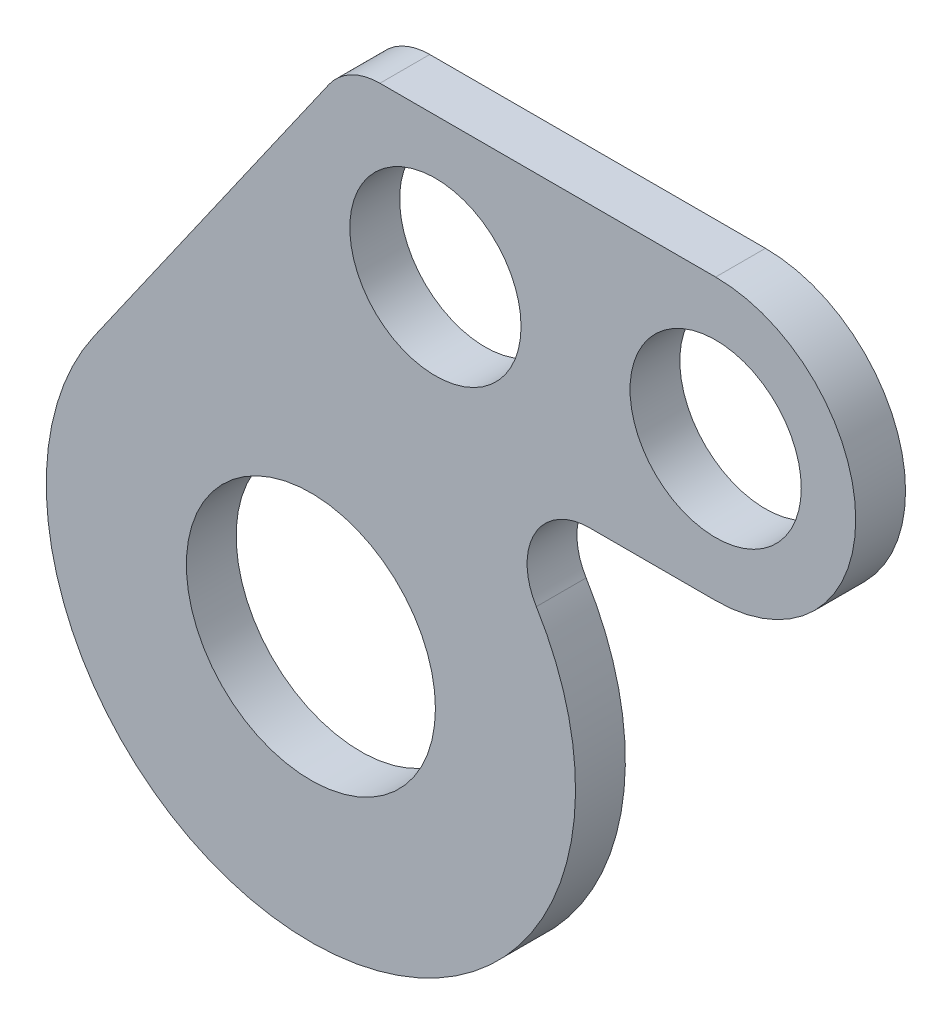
ISO-10303-21;
HEADER;
FILE_DESCRIPTION(('STEP AP214'),'2;1');
FILE_NAME('part.step','',(''),(''),'','','');
FILE_SCHEMA(('AUTOMOTIVE_DESIGN { 1 0 10303 214 1 1 1 1 }'));
ENDSEC;
DATA;
#1=APPLICATION_CONTEXT('core data for automotive mechanical design processes');
#2=APPLICATION_PROTOCOL_DEFINITION('international standard','automotive_design',2000,#1);
#3=PRODUCT_CONTEXT('',#1,'mechanical');
#4=PRODUCT('Part','Part','',(#3));
#5=PRODUCT_RELATED_PRODUCT_CATEGORY('part','',(#4));
#6=PRODUCT_DEFINITION_FORMATION('','',#4);
#7=PRODUCT_DEFINITION_CONTEXT('part definition',#1,'design');
#8=PRODUCT_DEFINITION('design','',#6,#7);
#9=PRODUCT_DEFINITION_SHAPE('','',#8);
#10=(LENGTH_UNIT() NAMED_UNIT(*) SI_UNIT(.MILLI.,.METRE.));
#11=(NAMED_UNIT(*) PLANE_ANGLE_UNIT() SI_UNIT($,.RADIAN.));
#12=(NAMED_UNIT(*) SI_UNIT($,.STERADIAN.) SOLID_ANGLE_UNIT());
#13=UNCERTAINTY_MEASURE_WITH_UNIT(LENGTH_MEASURE(1.E-05),#10,'distance_accuracy_value','');
#14=(GEOMETRIC_REPRESENTATION_CONTEXT(3) GLOBAL_UNCERTAINTY_ASSIGNED_CONTEXT((#13)) GLOBAL_UNIT_ASSIGNED_CONTEXT((#10,
#11,#12)) REPRESENTATION_CONTEXT('',''));
#15=CARTESIAN_POINT('',(0.,0.,0.));
#16=DIRECTION('',(0.,0.,1.));
#17=DIRECTION('',(1.,0.,0.));
#18=AXIS2_PLACEMENT_3D('',#15,#16,#17);
#19=CARTESIAN_POINT('',(0.,0.,1.6));
#20=DIRECTION('',(0.,0.,-1.));
#21=DIRECTION('',(-1.,0.,0.));
#22=AXIS2_PLACEMENT_3D('',#19,#20,#21);
#23=CYLINDRICAL_SURFACE('',#22,8.5);
#24=CARTESIAN_POINT('',(0.,0.,0.));
#25=DIRECTION('',(0.,0.,1.));
#26=DIRECTION('',(1.,0.,0.));
#27=AXIS2_PLACEMENT_3D('',#24,#25,#26);
#28=CIRCLE('',#27,8.5);
#29=CARTESIAN_POINT('',(-6.96279237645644,4.87539970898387,0.));
#30=VERTEX_POINT('',#29);
#31=CARTESIAN_POINT('',(7.24060106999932,4.45238095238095,0.));
#32=VERTEX_POINT('',#31);
#33=EDGE_CURVE('E149',#30,#32,#28,.T.);
#34=ORIENTED_EDGE('',*,*,#33,.T.);
#35=DIRECTION('',(0.,0.,-1.));
#36=VECTOR('',#35,1.);
#37=CARTESIAN_POINT('',(7.24060106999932,4.45238095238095,1.6));
#38=LINE('',#37,#36);
#39=CARTESIAN_POINT('',(7.24060106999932,4.45238095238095,1.6));
#40=VERTEX_POINT('',#39);
#41=EDGE_CURVE('E73',#32,#40,#38,.F.);
#42=ORIENTED_EDGE('',*,*,#41,.T.);
#43=CARTESIAN_POINT('',(0.,0.,1.6));
#44=DIRECTION('',(0.,0.,1.));
#45=DIRECTION('',(1.,0.,0.));
#46=AXIS2_PLACEMENT_3D('',#43,#44,#45);
#47=CIRCLE('',#46,8.5);
#48=CARTESIAN_POINT('',(-6.96279237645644,4.87539970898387,1.6));
#49=VERTEX_POINT('',#48);
#50=EDGE_CURVE('E136',#49,#40,#47,.T.);
#51=ORIENTED_EDGE('',*,*,#50,.F.);
#52=DIRECTION('',(0.,0.,-1.));
#53=VECTOR('',#52,1.);
#54=CARTESIAN_POINT('',(-6.96279237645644,4.87539970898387,1.6));
#55=LINE('',#54,#53);
#56=EDGE_CURVE('E148',#49,#30,#55,.T.);
#57=ORIENTED_EDGE('',*,*,#56,.T.);
#58=EDGE_LOOP('',(#34,#42,#51,#57));
#59=FACE_BOUND('',#58,.T.);
#60=ADVANCED_FACE('F51',(#59),#23,.T.);
#61=CARTESIAN_POINT('',(0.,7.5,1.6));
#62=DIRECTION('',(0.,-1.,0.));
#63=DIRECTION('',(0.,0.,-1.));
#64=AXIS2_PLACEMENT_3D('',#61,#62,#63);
#65=PLANE('',#64);
#66=DIRECTION('',(-1.,0.,0.));
#67=VECTOR('',#66,1.);
#68=CARTESIAN_POINT('',(0.,7.5,1.6));
#69=LINE('',#68,#67);
#70=CARTESIAN_POINT('',(13.,7.5,1.6));
#71=VERTEX_POINT('',#70);
#72=CARTESIAN_POINT('',(8.94427190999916,7.5,1.6));
#73=VERTEX_POINT('',#72);
#74=EDGE_CURVE('E115',#71,#73,#69,.T.);
#75=ORIENTED_EDGE('',*,*,#74,.T.);
#76=DIRECTION('',(0.,0.,-1.));
#77=VECTOR('',#76,1.);
#78=CARTESIAN_POINT('',(8.94427190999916,7.5,1.6));
#79=LINE('',#78,#77);
#80=CARTESIAN_POINT('',(8.94427190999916,7.5,0.));
#81=VERTEX_POINT('',#80);
#82=EDGE_CURVE('E181',#73,#81,#79,.T.);
#83=ORIENTED_EDGE('',*,*,#82,.T.);
#84=DIRECTION('',(-1.,0.,0.));
#85=VECTOR('',#84,1.);
#86=CARTESIAN_POINT('',(0.,7.5,0.));
#87=LINE('',#86,#85);
#88=CARTESIAN_POINT('',(13.,7.5,0.));
#89=VERTEX_POINT('',#88);
#90=EDGE_CURVE('E118',#89,#81,#87,.T.);
#91=ORIENTED_EDGE('',*,*,#90,.F.);
#92=DIRECTION('',(0.,0.,-1.));
#93=VECTOR('',#92,1.);
#94=CARTESIAN_POINT('',(13.,7.5,1.6));
#95=LINE('',#94,#93);
#96=EDGE_CURVE('E111',#71,#89,#95,.T.);
#97=ORIENTED_EDGE('',*,*,#96,.F.);
#98=EDGE_LOOP('',(#75,#83,#91,#97));
#99=FACE_BOUND('',#98,.T.);
#100=ADVANCED_FACE('F113',(#99),#65,.T.);
#101=CARTESIAN_POINT('',(13.,12.,1.6));
#102=DIRECTION('',(0.,0.,-1.));
#103=DIRECTION('',(-1.,0.,0.));
#104=AXIS2_PLACEMENT_3D('',#101,#102,#103);
#105=CYLINDRICAL_SURFACE('',#104,4.5);
#106=CARTESIAN_POINT('',(13.,12.,0.));
#107=DIRECTION('',(0.,0.,1.));
#108=DIRECTION('',(1.,0.,0.));
#109=AXIS2_PLACEMENT_3D('',#106,#107,#108);
#110=CIRCLE('',#109,4.5);
#111=CARTESIAN_POINT('',(13.,16.5,0.));
#112=VERTEX_POINT('',#111);
#113=EDGE_CURVE('E155',#89,#112,#110,.T.);
#114=ORIENTED_EDGE('',*,*,#113,.T.);
#115=DIRECTION('',(0.,0.,-1.));
#116=VECTOR('',#115,1.);
#117=CARTESIAN_POINT('',(13.,16.5,1.6));
#118=LINE('',#117,#116);
#119=CARTESIAN_POINT('',(13.,16.5,1.6));
#120=VERTEX_POINT('',#119);
#121=EDGE_CURVE('E123',#120,#112,#118,.T.);
#122=ORIENTED_EDGE('',*,*,#121,.F.);
#123=CARTESIAN_POINT('',(13.,12.,1.6));
#124=DIRECTION('',(0.,0.,1.));
#125=DIRECTION('',(1.,0.,0.));
#126=AXIS2_PLACEMENT_3D('',#123,#124,#125);
#127=CIRCLE('',#126,4.5);
#128=EDGE_CURVE('E126',#71,#120,#127,.T.);
#129=ORIENTED_EDGE('',*,*,#128,.F.);
#130=ORIENTED_EDGE('',*,*,#96,.T.);
#131=EDGE_LOOP('',(#114,#122,#129,#130));
#132=FACE_BOUND('',#131,.T.);
#133=ADVANCED_FACE('F127',(#132),#105,.T.);
#134=CARTESIAN_POINT('',(0.,16.5,1.6));
#135=DIRECTION('',(0.,-1.,0.));
#136=DIRECTION('',(0.,0.,-1.));
#137=AXIS2_PLACEMENT_3D('',#134,#135,#136);
#138=PLANE('',#137);
#139=DIRECTION('',(-1.,0.,0.));
#140=VECTOR('',#139,1.);
#141=CARTESIAN_POINT('',(0.,16.5,0.));
#142=LINE('',#141,#140);
#143=CARTESIAN_POINT('',(2.21797447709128,16.5,0.));
#144=VERTEX_POINT('',#143);
#145=EDGE_CURVE('E158',#112,#144,#142,.T.);
#146=ORIENTED_EDGE('',*,*,#145,.T.);
#147=DIRECTION('',(0.,0.,-1.));
#148=VECTOR('',#147,1.);
#149=CARTESIAN_POINT('',(2.21797447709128,16.5,1.6));
#150=LINE('',#149,#148);
#151=CARTESIAN_POINT('',(2.21797447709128,16.5,1.6));
#152=VERTEX_POINT('',#151);
#153=EDGE_CURVE('E175',#144,#152,#150,.F.);
#154=ORIENTED_EDGE('',*,*,#153,.T.);
#155=DIRECTION('',(-1.,0.,0.));
#156=VECTOR('',#155,1.);
#157=CARTESIAN_POINT('',(0.,16.5,1.6));
#158=LINE('',#157,#156);
#159=EDGE_CURVE('E132',#120,#152,#158,.T.);
#160=ORIENTED_EDGE('',*,*,#159,.F.);
#161=ORIENTED_EDGE('',*,*,#121,.T.);
#162=EDGE_LOOP('',(#146,#154,#160,#161));
#163=FACE_BOUND('',#162,.T.);
#164=ADVANCED_FACE('F212',(#163),#138,.F.);
#165=CARTESIAN_POINT('',(-6.96279237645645,4.87539970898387,1.6));
#166=DIRECTION('',(0.819152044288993,-0.573576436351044,0.));
#167=DIRECTION('',(0.573576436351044,0.819152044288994,0.));
#168=AXIS2_PLACEMENT_3D('',#165,#166,#167);
#169=PLANE('',#168);
#170=DIRECTION('',(-0.573576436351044,-0.819152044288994,0.));
#171=VECTOR('',#170,1.);
#172=CARTESIAN_POINT('',(-6.96279237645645,4.87539970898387,1.6));
#173=LINE('',#172,#171);
#174=CARTESIAN_POINT('',(0.579670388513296,15.6471528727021,1.6));
#175=VERTEX_POINT('',#174);
#176=EDGE_CURVE('E145',#175,#49,#173,.T.);
#177=ORIENTED_EDGE('',*,*,#176,.F.);
#178=DIRECTION('',(0.,0.,-1.));
#179=VECTOR('',#178,1.);
#180=CARTESIAN_POINT('',(0.579670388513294,15.6471528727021,1.6));
#181=LINE('',#180,#179);
#182=CARTESIAN_POINT('',(0.579670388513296,15.6471528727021,0.));
#183=VERTEX_POINT('',#182);
#184=EDGE_CURVE('E122',#175,#183,#181,.T.);
#185=ORIENTED_EDGE('',*,*,#184,.T.);
#186=DIRECTION('',(-0.573576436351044,-0.819152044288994,0.));
#187=VECTOR('',#186,1.);
#188=CARTESIAN_POINT('',(-6.96279237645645,4.87539970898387,0.));
#189=LINE('',#188,#187);
#190=EDGE_CURVE('E139',#183,#30,#189,.T.);
#191=ORIENTED_EDGE('',*,*,#190,.T.);
#192=ORIENTED_EDGE('',*,*,#56,.F.);
#193=EDGE_LOOP('',(#177,#185,#191,#192));
#194=FACE_BOUND('',#193,.T.);
#195=ADVANCED_FACE('F215',(#194),#169,.F.);
#196=CARTESIAN_POINT('',(0.,0.,1.6));
#197=DIRECTION('',(0.,0.,1.));
#198=DIRECTION('',(1.,0.,0.));
#199=AXIS2_PLACEMENT_3D('',#196,#197,#198);
#200=PLANE('',#199);
#201=CARTESIAN_POINT('',(0.,0.,1.6));
#202=DIRECTION('',(0.,0.,1.));
#203=DIRECTION('',(1.,0.,0.));
#204=AXIS2_PLACEMENT_3D('',#201,#202,#203);
#205=CIRCLE('',#204,4.);
#206=CARTESIAN_POINT('',(4.,0.,1.6));
#207=VERTEX_POINT('',#206);
#208=EDGE_CURVE('E239',#207,#207,#205,.T.);
#209=ORIENTED_EDGE('',*,*,#208,.F.);
#210=EDGE_LOOP('',(#209));
#211=FACE_BOUND('',#210,.T.);
#212=CARTESIAN_POINT('',(13.,12.,1.6));
#213=DIRECTION('',(0.,0.,1.));
#214=DIRECTION('',(1.,0.,0.));
#215=AXIS2_PLACEMENT_3D('',#212,#213,#214);
#216=CIRCLE('',#215,2.75);
#217=CARTESIAN_POINT('',(15.75,12.,1.6));
#218=VERTEX_POINT('',#217);
#219=EDGE_CURVE('E247',#218,#218,#216,.T.);
#220=ORIENTED_EDGE('',*,*,#219,.F.);
#221=EDGE_LOOP('',(#220));
#222=FACE_BOUND('',#221,.T.);
#223=CARTESIAN_POINT('',(4.,12.,1.6));
#224=DIRECTION('',(0.,0.,1.));
#225=DIRECTION('',(1.,0.,0.));
#226=AXIS2_PLACEMENT_3D('',#223,#224,#225);
#227=CIRCLE('',#226,2.75);
#228=CARTESIAN_POINT('',(6.75,12.,1.6));
#229=VERTEX_POINT('',#228);
#230=EDGE_CURVE('E256',#229,#229,#227,.T.);
#231=ORIENTED_EDGE('',*,*,#230,.F.);
#232=EDGE_LOOP('',(#231));
#233=FACE_BOUND('',#232,.T.);
#234=ORIENTED_EDGE('',*,*,#159,.T.);
#235=CARTESIAN_POINT('',(2.21797447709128,14.5,1.6));
#236=DIRECTION('',(0.,0.,1.));
#237=DIRECTION('',(1.,0.,0.));
#238=AXIS2_PLACEMENT_3D('',#235,#236,#237);
#239=CIRCLE('',#238,2.);
#240=EDGE_CURVE('E178',#152,#175,#239,.T.);
#241=ORIENTED_EDGE('',*,*,#240,.T.);
#242=ORIENTED_EDGE('',*,*,#176,.T.);
#243=ORIENTED_EDGE('',*,*,#50,.T.);
#244=CARTESIAN_POINT('',(8.94427190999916,5.5,1.6));
#245=DIRECTION('',(0.,0.,1.));
#246=DIRECTION('',(1.,0.,0.));
#247=AXIS2_PLACEMENT_3D('',#244,#245,#246);
#248=CIRCLE('',#247,2.);
#249=EDGE_CURVE('E13',#40,#73,#248,.F.);
#250=ORIENTED_EDGE('',*,*,#249,.T.);
#251=ORIENTED_EDGE('',*,*,#74,.F.);
#252=ORIENTED_EDGE('',*,*,#128,.T.);
#253=EDGE_LOOP('',(#234,#241,#242,#243,#250,#251,#252));
#254=FACE_BOUND('',#253,.T.);
#255=ADVANCED_FACE('F134',(#211,#222,#233,#254),#200,.T.);
#256=CARTESIAN_POINT('',(0.,0.,0.));
#257=DIRECTION('',(0.,0.,1.));
#258=DIRECTION('',(1.,0.,0.));
#259=AXIS2_PLACEMENT_3D('',#256,#257,#258);
#260=PLANE('',#259);
#261=CARTESIAN_POINT('',(0.,0.,0.));
#262=DIRECTION('',(0.,0.,1.));
#263=DIRECTION('',(1.,0.,0.));
#264=AXIS2_PLACEMENT_3D('',#261,#262,#263);
#265=CIRCLE('',#264,4.);
#266=CARTESIAN_POINT('',(4.,0.,0.));
#267=VERTEX_POINT('',#266);
#268=EDGE_CURVE('E152',#267,#267,#265,.T.);
#269=ORIENTED_EDGE('',*,*,#268,.T.);
#270=EDGE_LOOP('',(#269));
#271=FACE_BOUND('',#270,.T.);
#272=CARTESIAN_POINT('',(13.,12.,0.));
#273=DIRECTION('',(0.,0.,1.));
#274=DIRECTION('',(1.,0.,0.));
#275=AXIS2_PLACEMENT_3D('',#272,#273,#274);
#276=CIRCLE('',#275,2.75);
#277=CARTESIAN_POINT('',(15.75,12.,0.));
#278=VERTEX_POINT('',#277);
#279=EDGE_CURVE('E241',#278,#278,#276,.T.);
#280=ORIENTED_EDGE('',*,*,#279,.T.);
#281=EDGE_LOOP('',(#280));
#282=FACE_BOUND('',#281,.T.);
#283=CARTESIAN_POINT('',(4.,12.,0.));
#284=DIRECTION('',(0.,0.,1.));
#285=DIRECTION('',(1.,0.,0.));
#286=AXIS2_PLACEMENT_3D('',#283,#284,#285);
#287=CIRCLE('',#286,2.75);
#288=CARTESIAN_POINT('',(6.75,12.,0.));
#289=VERTEX_POINT('',#288);
#290=EDGE_CURVE('E253',#289,#289,#287,.T.);
#291=ORIENTED_EDGE('',*,*,#290,.T.);
#292=EDGE_LOOP('',(#291));
#293=FACE_BOUND('',#292,.T.);
#294=ORIENTED_EDGE('',*,*,#190,.F.);
#295=CARTESIAN_POINT('',(2.21797447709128,14.5,0.));
#296=DIRECTION('',(0.,0.,1.));
#297=DIRECTION('',(1.,0.,0.));
#298=AXIS2_PLACEMENT_3D('',#295,#296,#297);
#299=CIRCLE('',#298,2.);
#300=EDGE_CURVE('E172',#183,#144,#299,.F.);
#301=ORIENTED_EDGE('',*,*,#300,.T.);
#302=ORIENTED_EDGE('',*,*,#145,.F.);
#303=ORIENTED_EDGE('',*,*,#113,.F.);
#304=ORIENTED_EDGE('',*,*,#90,.T.);
#305=CARTESIAN_POINT('',(8.94427190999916,5.5,0.));
#306=DIRECTION('',(0.,0.,1.));
#307=DIRECTION('',(1.,0.,0.));
#308=AXIS2_PLACEMENT_3D('',#305,#306,#307);
#309=CIRCLE('',#308,2.);
#310=EDGE_CURVE('E60',#81,#32,#309,.T.);
#311=ORIENTED_EDGE('',*,*,#310,.T.);
#312=ORIENTED_EDGE('',*,*,#33,.F.);
#313=EDGE_LOOP('',(#294,#301,#302,#303,#304,#311,#312));
#314=FACE_BOUND('',#313,.T.);
#315=ADVANCED_FACE('F189',(#271,#282,#293,#314),#260,.F.);
#316=CARTESIAN_POINT('',(2.21797447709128,14.5,1.6));
#317=DIRECTION('',(0.,0.,-1.));
#318=DIRECTION('',(-1.,0.,0.));
#319=AXIS2_PLACEMENT_3D('',#316,#317,#318);
#320=CYLINDRICAL_SURFACE('',#319,2.);
#321=ORIENTED_EDGE('',*,*,#240,.F.);
#322=ORIENTED_EDGE('',*,*,#153,.F.);
#323=ORIENTED_EDGE('',*,*,#300,.F.);
#324=ORIENTED_EDGE('',*,*,#184,.F.);
#325=EDGE_LOOP('',(#321,#322,#323,#324));
#326=FACE_BOUND('',#325,.T.);
#327=ADVANCED_FACE('F194',(#326),#320,.T.);
#328=CARTESIAN_POINT('',(8.94427190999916,5.5,1.6));
#329=DIRECTION('',(0.,0.,-1.));
#330=DIRECTION('',(-1.,0.,0.));
#331=AXIS2_PLACEMENT_3D('',#328,#329,#330);
#332=CYLINDRICAL_SURFACE('',#331,2.);
#333=ORIENTED_EDGE('',*,*,#249,.F.);
#334=ORIENTED_EDGE('',*,*,#41,.F.);
#335=ORIENTED_EDGE('',*,*,#310,.F.);
#336=ORIENTED_EDGE('',*,*,#82,.F.);
#337=EDGE_LOOP('',(#333,#334,#335,#336));
#338=FACE_BOUND('',#337,.T.);
#339=ADVANCED_FACE('F53',(#338),#332,.F.);
#340=CARTESIAN_POINT('',(4.,12.,0.));
#341=DIRECTION('',(0.,0.,1.));
#342=DIRECTION('',(1.,0.,0.));
#343=AXIS2_PLACEMENT_3D('',#340,#341,#342);
#344=CYLINDRICAL_SURFACE('',#343,2.75);
#345=ORIENTED_EDGE('',*,*,#290,.F.);
#346=EDGE_LOOP('',(#345));
#347=FACE_BOUND('',#346,.T.);
#348=ORIENTED_EDGE('',*,*,#230,.T.);
#349=EDGE_LOOP('',(#348));
#350=FACE_BOUND('',#349,.T.);
#351=ADVANCED_FACE('F193',(#347,#350),#344,.F.);
#352=CARTESIAN_POINT('',(13.,12.,0.));
#353=DIRECTION('',(0.,0.,1.));
#354=DIRECTION('',(1.,0.,0.));
#355=AXIS2_PLACEMENT_3D('',#352,#353,#354);
#356=CYLINDRICAL_SURFACE('',#355,2.75);
#357=ORIENTED_EDGE('',*,*,#279,.F.);
#358=EDGE_LOOP('',(#357));
#359=FACE_BOUND('',#358,.T.);
#360=ORIENTED_EDGE('',*,*,#219,.T.);
#361=EDGE_LOOP('',(#360));
#362=FACE_BOUND('',#361,.T.);
#363=ADVANCED_FACE('F199',(#359,#362),#356,.F.);
#364=CARTESIAN_POINT('',(0.,0.,0.));
#365=DIRECTION('',(0.,0.,1.));
#366=DIRECTION('',(1.,0.,0.));
#367=AXIS2_PLACEMENT_3D('',#364,#365,#366);
#368=CYLINDRICAL_SURFACE('',#367,4.);
#369=ORIENTED_EDGE('',*,*,#268,.F.);
#370=EDGE_LOOP('',(#369));
#371=FACE_BOUND('',#370,.T.);
#372=ORIENTED_EDGE('',*,*,#208,.T.);
#373=EDGE_LOOP('',(#372));
#374=FACE_BOUND('',#373,.T.);
#375=ADVANCED_FACE('F228',(#371,#374),#368,.F.);
#376=CLOSED_SHELL('',(#60,#100,#133,#164,#195,#255,#315,#327,#339,#351,#363,#375));
#377=MANIFOLD_SOLID_BREP('B2',#376);
#378=ADVANCED_BREP_SHAPE_REPRESENTATION('',(#18,#377),#14);
#379=SHAPE_DEFINITION_REPRESENTATION(#9,#378);
ENDSEC;
END-ISO-10303-21;
